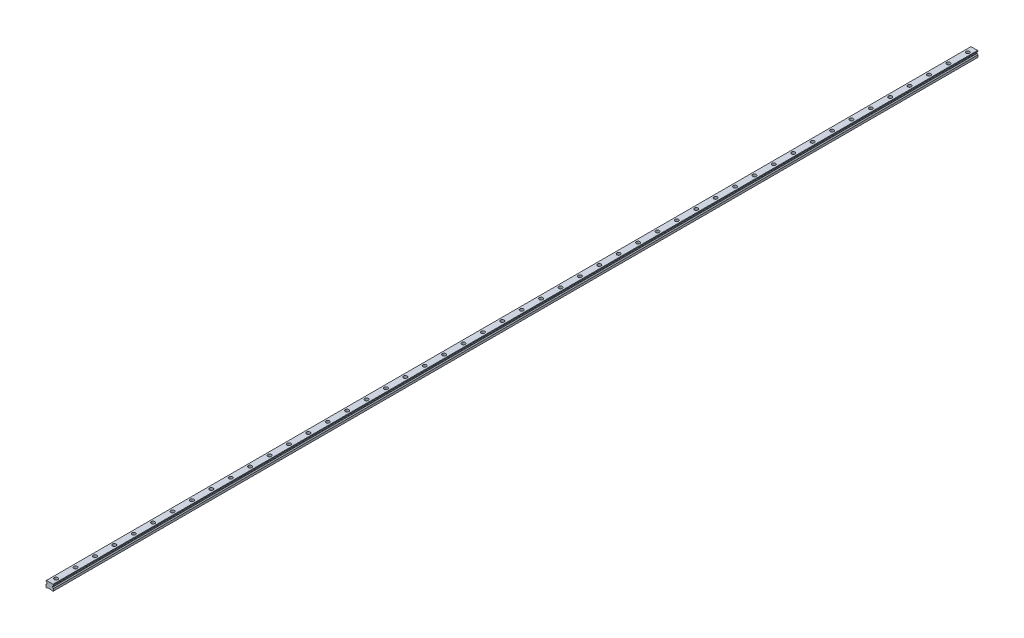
from build123d import *

# Parameters (mm, degrees)
SKETCH1_W           = 23
SKETCH1_H           = 19.2
BOSS_EXTRUDE1_DEPTH = 1430
CUT_EXTRUDE1_DEPTH  = 2861.087566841
CHAMFER1_SIZE       = 1.25
FILLET1_R           = 1.25
CUT_EXTRUDE2_DEPTH  = 2861.087566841
SKETCH4_R           = 5.5
SKETCH4_R_2         = 3.5
CUT_EXTRUDE3_DEPTH  = 9
SKETCH4_2_R         = 3.5
CUT_EXTRUDE4_DEPTH  = 1431.17512564
LPATTERN1_COUNT     = 48
LPATTERN1_PITCH     = 60


with BuildPart() as part:
    # Sketch1 → Boss-Extrude1 (new, symmetric)
    with BuildSketch(Plane.XY):
        with Locations((0, 9.6)):
            Rectangle(SKETCH1_W, SKETCH1_H)
    extrude(amount=BOSS_EXTRUDE1_DEPTH, both=True)

    # Sketch2 → Cut-Extrude1 (cut, through all)
    with BuildSketch(Plane.XY.offset(1430)):
        Polygon((-11.5, 16.7), (-11.5, 7.95), (-8.583333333, 10.866666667), (-8.583333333, 13.783333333), align=None)
        Polygon((8.583333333, 13.783333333), (11.5, 16.7), (11.5, 7.95), (8.583333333, 10.866666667), align=None)
    extrude(amount=-CUT_EXTRUDE1_DEPTH, mode=Mode.SUBTRACT)

    # Chamfer1
    chamfer1_edges = [part.edges().sort_by_distance(p)[0] for p in [
        (-11.5, 19.2, 0),
        (11.5, 19.2, 0),
        (11.5, 0, 0),
        (-11.5, 0, 0),
    ]]
    chamfer(chamfer1_edges, length=CHAMFER1_SIZE)

    # Fillet1
    fillet1_edges = [part.edges().sort_by_distance(p)[0] for p in [
        (-8.583333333, 13.783333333, 0),
        (-8.583333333, 10.866666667, 0),
        (8.583333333, 10.866666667, 0),
        (8.583333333, 13.783333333, 0),
    ]]
    fillet(fillet1_edges, radius=FILLET1_R)

    # Sketch3 → Cut-Extrude2 (cut, through all)
    with BuildSketch(Plane.XY.offset(1430)):
        Polygon((-7, 0), (-5.75, 1.25), (5.75, 1.25), (7, 0), align=None)
    extrude(amount=-CUT_EXTRUDE2_DEPTH, mode=Mode.SUBTRACT)

    # Sketch4 → Cut-Extrude3 (cut)
    with BuildSketch(Plane(origin=(0, 19.2, 0), x_dir=(1, 0, 0), z_dir=(0, 1, 0))):
        with Locations(Location((0, -1410, 0), (0, 0, 270))):
            Circle(SKETCH4_R)
        with Locations(Location((0, -1410, 0), (0, 0, 270))):
            Circle(SKETCH4_R_2, mode=Mode.SUBTRACT)
    cut_extrude3 = extrude(amount=-CUT_EXTRUDE3_DEPTH, mode=Mode.SUBTRACT)

    # Sketch4_2 → Cut-Extrude4 (cut, through all)
    with BuildSketch(Plane(origin=(0, 19.2, 0), x_dir=(1, 0, 0), z_dir=(0, 1, 0))):
        with Locations(Location((0, -1410, 0), (0, 0, 270))):
            Circle(SKETCH4_2_R)
    cut_extrude4 = extrude(amount=-CUT_EXTRUDE4_DEPTH, mode=Mode.SUBTRACT)

    # LPattern1: Cut-Extrude3, Cut-Extrude4 ×48
    with Locations(*[(0, 0, -i * LPATTERN1_PITCH) for i in range(1, LPATTERN1_COUNT)]):
        add(cut_extrude3, mode=Mode.SUBTRACT)
        add(cut_extrude4, mode=Mode.SUBTRACT)


solid = part.part
